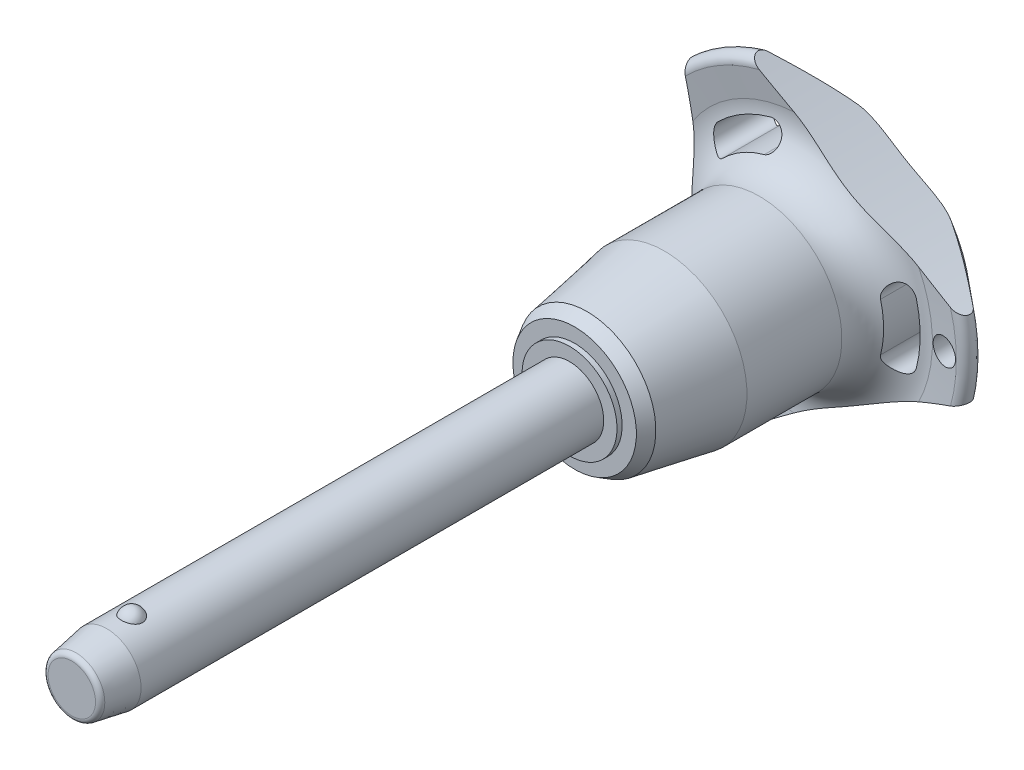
from build123d import *

# Parameters (mm, degrees)
SKETCH1_R           = 4
BOSS_EXTRUDE1_DEPTH = 50
SKETCH2_R           = 3.4
BOSS_EXTRUDE2_DEPTH = 33.3
BOSS_EXTRUDE3_START = 8.2
SKETCH1_2_R         = 4
BOSS_EXTRUDE3_DEPTH = 8.2
CHAMFER1_SIZE       = 4.1
CHAMFER1_SIZE2      = 0.722940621
FILLET1_R           = 0.6
SKETCH6_R           = 102.8
CUT_EXTRUDE1_DEPTH  = 88.794135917
CIRPATTERN1_COUNT   = 3
SKETCH7_R           = 1.5
CUT_EXTRUDE2_DEPTH  = 88.609718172


with BuildPart() as part:
    # Sketch1 → Boss-Extrude1 (new body)
    with BuildSketch(Plane.XY):
        Circle(SKETCH1_R)
    extrude(amount=-BOSS_EXTRUDE1_DEPTH)

    # Sketch2 → Boss-Extrude2 (add)
    with BuildSketch(Plane(origin=(0, 0, -50), x_dir=(-1, 0, 0), z_dir=(0, 0, -1))):
        Circle(SKETCH2_R)
    extrude(amount=BOSS_EXTRUDE2_DEPTH)

    # Sketch3 → Revolve1 (revolve)
    with BuildSketch(Plane(origin=(0, 0, 0), x_dir=(0, 0, -1), z_dir=(1, 0, 0))):
        with BuildLine():
            Line((-1.2, 4.8), (-1.2, 2.2))
            ThreePointArc((-1.2, 2.2), (0.1, 3.5), (-1.2, 4.8))
        make_face()
        with BuildLine():
            Line((-1.2, -2.2), (-1.2, -4.8))
            ThreePointArc((-1.2, -4.8), (0.1, -3.5), (-1.2, -2.2))
        make_face()
    revolve(axis=Axis((0, -2.2, 1.2), (0, 1, 0)))

    # Sketch1_2 → Boss-Extrude3 (add)
    with BuildSketch(Plane.XY.offset(BOSS_EXTRUDE3_START)):
        Circle(SKETCH1_2_R)
    extrude(amount=-BOSS_EXTRUDE3_DEPTH)

    # Chamfer1
    chamfer1_edges = [part.edges().sort_by_distance(p)[0] for p in [
        (-4, 0, 8.2),
    ]]
    chamfer1_side = [part.faces().sort_by_distance(p)[0] for p in [
        (-4, 0, -20.9),
    ]]
    chamfer(chamfer1_edges, length=CHAMFER1_SIZE, length2=CHAMFER1_SIZE2, reference=chamfer1_side[0])

    # Fillet1
    fillet1_edges = [part.edges().sort_by_distance(p)[0] for p in [
        (-3.277059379, 0, 8.2),
        (3.4, 0, -83.3),
    ]]
    fillet(fillet1_edges, radius=FILLET1_R)

    # Sketch4 → Revolve2 (revolve)
    with BuildSketch(Plane(origin=(0, 0, 0), x_dir=(0, 0, -1), z_dir=(1, 0, 0)), mode=Mode.PRIVATE) as revolve2_sk:
        Polygon((50, 0), (50, 5.554101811), (50.6, 5.554101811), (50.6, 7.220004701), (52.042714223, 8.052956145), (61.1, 9.65), (72.2, 9.65), (72.2, 0), align=None)
    revolve(revolve2_sk.sketch.rotate(Axis((0, 0, -72.2), (0, 0, 1)), 90), axis=Axis((0, 0, -72.2), (0, 0, 1)))

    # Sketch5 → Revolve3 (revolve)
    with BuildSketch(Plane(origin=(0, 0, 0), x_dir=(0, 0, -1), z_dir=(1, 0, 0)), mode=Mode.PRIVATE) as revolve3_sk:
        with BuildLine():
            Line((77.16082631, 15.274661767), (76.757834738, 18.475067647))
            ThreePointArc((76.757834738, 18.475067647), (77.349836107, 19.516443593), (78.516044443, 19.24278761))
            Line((78.516044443, 19.24278761), (82.835691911, 14.094832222))
            ThreePointArc((82.835691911, 14.094832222), (83.3, 12.689260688), (82.67067517, 11.349423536))
            ThreePointArc((82.67067517, 11.349423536), (79.033110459, 6.185112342), (77.75, 0))
            Line((77.75, 0), (72.2, 0))
            Line((72.2, 0), (72.2, 9.65))
            ThreePointArc((72.2, 9.65), (75.949887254, 11.342683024), (77.16082631, 15.274661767))
        make_face()
    revolve(revolve3_sk.sketch.rotate(Axis((0, 0, -77.75), (0, 0, 1)), 90), axis=Axis((0, 0, -77.75), (0, 0, 1)))

    # Sketch6 → Cut-Extrude1 (cut, through all)
    with BuildSketch(Plane.XY):
        with Locations((-115.2, 0)):
            Circle(SKETCH6_R)
        with BuildLine():
            ThreePointArc((13.411913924, -3.529271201), (13.868496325, 0), (13.411913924, 3.529271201))
            ThreePointArc((13.411913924, 3.529271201), (11.694200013, 4.531299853), (10.692171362, 2.813585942))
            ThreePointArc((10.692171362, 2.813585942), (11.056165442, 0), (10.692171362, -2.813585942))
            ThreePointArc((10.692171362, -2.813585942), (11.694200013, -4.531299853), (13.411913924, -3.529271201))
        make_face()
    cut_extrude1 = extrude(amount=-CUT_EXTRUDE1_DEPTH, mode=Mode.SUBTRACT)

    # CirPattern1: Cut-Extrude1 ×3 about axis
    cirpattern1_axis = Axis((0, 0, 0), (0, 0, 1))
    for i in range(1, CIRPATTERN1_COUNT):
        add(cut_extrude1.rotate(cirpattern1_axis, i * 360 / CIRPATTERN1_COUNT), mode=Mode.SUBTRACT)

    # Sketch7 → Cut-Extrude2 (cut, through all)
    with BuildSketch(Plane.XY):
        with Locations(Location((16.868496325, 0, 0), (0, 0, 225.467095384))):
            Circle(SKETCH7_R)
    extrude(amount=-CUT_EXTRUDE2_DEPTH, mode=Mode.SUBTRACT)


solid = part.part
